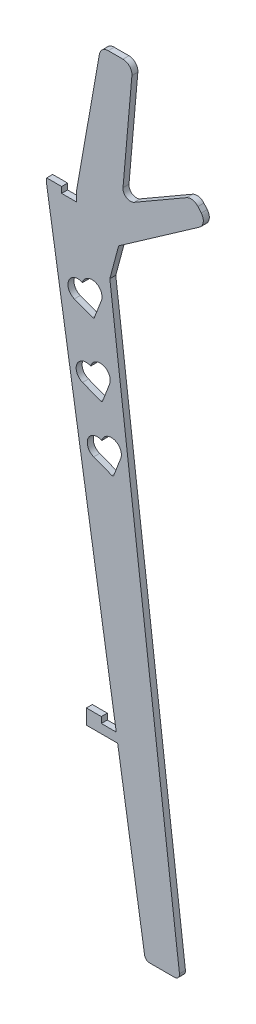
ISO-10303-21;
HEADER;
FILE_DESCRIPTION(('STEP AP214'),'2;1');
FILE_NAME('part.step','',(''),(''),'','','');
FILE_SCHEMA(('AUTOMOTIVE_DESIGN { 1 0 10303 214 1 1 1 1 }'));
ENDSEC;
DATA;
#1=APPLICATION_CONTEXT('core data for automotive mechanical design processes');
#2=APPLICATION_PROTOCOL_DEFINITION('international standard','automotive_design',2000,#1);
#3=PRODUCT_CONTEXT('',#1,'mechanical');
#4=PRODUCT('Part','Part','',(#3));
#5=PRODUCT_RELATED_PRODUCT_CATEGORY('part','',(#4));
#6=PRODUCT_DEFINITION_FORMATION('','',#4);
#7=PRODUCT_DEFINITION_CONTEXT('part definition',#1,'design');
#8=PRODUCT_DEFINITION('design','',#6,#7);
#9=PRODUCT_DEFINITION_SHAPE('','',#8);
#10=(LENGTH_UNIT() NAMED_UNIT(*) SI_UNIT(.MILLI.,.METRE.));
#11=(NAMED_UNIT(*) PLANE_ANGLE_UNIT() SI_UNIT($,.RADIAN.));
#12=(NAMED_UNIT(*) SI_UNIT($,.STERADIAN.) SOLID_ANGLE_UNIT());
#13=UNCERTAINTY_MEASURE_WITH_UNIT(LENGTH_MEASURE(1.E-05),#10,'distance_accuracy_value','');
#14=(GEOMETRIC_REPRESENTATION_CONTEXT(3) GLOBAL_UNCERTAINTY_ASSIGNED_CONTEXT((#13)) GLOBAL_UNIT_ASSIGNED_CONTEXT((#10,
#11,#12)) REPRESENTATION_CONTEXT('',''));
#15=CARTESIAN_POINT('',(0.,0.,0.));
#16=DIRECTION('',(0.,0.,1.));
#17=DIRECTION('',(1.,0.,0.));
#18=AXIS2_PLACEMENT_3D('',#15,#16,#17);
#19=CARTESIAN_POINT('',(6.71452596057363,380.,12.));
#20=DIRECTION('',(0.,-1.,0.));
#21=DIRECTION('',(1.,0.,0.));
#22=AXIS2_PLACEMENT_3D('',#19,#20,#21);
#23=PLANE('',#22);
#24=DIRECTION('',(-1.,0.,0.));
#25=VECTOR('',#24,1.);
#26=CARTESIAN_POINT('',(6.71452596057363,380.,0.));
#27=LINE('',#26,#25);
#28=CARTESIAN_POINT('',(36.7145259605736,380.,0.));
#29=VERTEX_POINT('',#28);
#30=CARTESIAN_POINT('',(6.71452596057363,380.,0.));
#31=VERTEX_POINT('',#30);
#32=EDGE_CURVE('E360',#29,#31,#27,.T.);
#33=ORIENTED_EDGE('',*,*,#32,.T.);
#34=DIRECTION('',(0.,0.,-1.));
#35=VECTOR('',#34,1.);
#36=CARTESIAN_POINT('',(6.71452596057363,380.,12.));
#37=LINE('',#36,#35);
#38=CARTESIAN_POINT('',(6.71452596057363,380.,12.));
#39=VERTEX_POINT('',#38);
#40=EDGE_CURVE('E11',#39,#31,#37,.T.);
#41=ORIENTED_EDGE('',*,*,#40,.F.);
#42=DIRECTION('',(-1.,0.,0.));
#43=VECTOR('',#42,1.);
#44=CARTESIAN_POINT('',(6.71452596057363,380.,12.));
#45=LINE('',#44,#43);
#46=CARTESIAN_POINT('',(36.7145259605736,380.,12.));
#47=VERTEX_POINT('',#46);
#48=EDGE_CURVE('E432',#47,#39,#45,.T.);
#49=ORIENTED_EDGE('',*,*,#48,.F.);
#50=DIRECTION('',(0.,0.,-1.));
#51=VECTOR('',#50,1.);
#52=CARTESIAN_POINT('',(36.7145259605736,380.,12.));
#53=LINE('',#52,#51);
#54=EDGE_CURVE('E490',#47,#29,#53,.T.);
#55=ORIENTED_EDGE('',*,*,#54,.T.);
#56=EDGE_LOOP('',(#33,#41,#49,#55));
#57=FACE_BOUND('',#56,.T.);
#58=ADVANCED_FACE('F45',(#57),#23,.F.);
#59=CARTESIAN_POINT('',(6.71452596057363,350.,12.));
#60=DIRECTION('',(1.,0.,0.));
#61=DIRECTION('',(0.,0.,-1.));
#62=AXIS2_PLACEMENT_3D('',#59,#60,#61);
#63=PLANE('',#62);
#64=DIRECTION('',(0.,-1.,0.));
#65=VECTOR('',#64,1.);
#66=CARTESIAN_POINT('',(6.71452596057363,350.,0.));
#67=LINE('',#66,#65);
#68=CARTESIAN_POINT('',(6.71452596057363,350.,0.));
#69=VERTEX_POINT('',#68);
#70=EDGE_CURVE('E493',#31,#69,#67,.T.);
#71=ORIENTED_EDGE('',*,*,#70,.T.);
#72=DIRECTION('',(0.,0.,-1.));
#73=VECTOR('',#72,1.);
#74=CARTESIAN_POINT('',(6.71452596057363,350.,12.));
#75=LINE('',#74,#73);
#76=CARTESIAN_POINT('',(6.71452596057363,350.,12.));
#77=VERTEX_POINT('',#76);
#78=EDGE_CURVE('E52',#77,#69,#75,.T.);
#79=ORIENTED_EDGE('',*,*,#78,.F.);
#80=DIRECTION('',(0.,-1.,0.));
#81=VECTOR('',#80,1.);
#82=CARTESIAN_POINT('',(6.71452596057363,350.,12.));
#83=LINE('',#82,#81);
#84=EDGE_CURVE('E435',#39,#77,#83,.T.);
#85=ORIENTED_EDGE('',*,*,#84,.F.);
#86=ORIENTED_EDGE('',*,*,#40,.T.);
#87=EDGE_LOOP('',(#71,#79,#85,#86));
#88=FACE_BOUND('',#87,.T.);
#89=ADVANCED_FACE('F649',(#88),#63,.F.);
#90=CARTESIAN_POINT('',(69.5654458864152,350.,12.));
#91=DIRECTION('',(0.,1.,0.));
#92=DIRECTION('',(0.,0.,1.));
#93=AXIS2_PLACEMENT_3D('',#90,#91,#92);
#94=PLANE('',#93);
#95=DIRECTION('',(1.,0.,0.));
#96=VECTOR('',#95,1.);
#97=CARTESIAN_POINT('',(69.5654458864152,350.,0.));
#98=LINE('',#97,#96);
#99=CARTESIAN_POINT('',(69.5654458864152,350.,0.));
#100=VERTEX_POINT('',#99);
#101=EDGE_CURVE('E495',#69,#100,#98,.T.);
#102=ORIENTED_EDGE('',*,*,#101,.T.);
#103=DIRECTION('',(0.,0.,-1.));
#104=VECTOR('',#103,1.);
#105=CARTESIAN_POINT('',(69.5654458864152,350.,12.));
#106=LINE('',#105,#104);
#107=CARTESIAN_POINT('',(69.5654458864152,350.,12.));
#108=VERTEX_POINT('',#107);
#109=EDGE_CURVE('E620',#108,#100,#106,.T.);
#110=ORIENTED_EDGE('',*,*,#109,.F.);
#111=DIRECTION('',(1.,0.,0.));
#112=VECTOR('',#111,1.);
#113=CARTESIAN_POINT('',(69.5654458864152,350.,12.));
#114=LINE('',#113,#112);
#115=EDGE_CURVE('E438',#77,#108,#114,.T.);
#116=ORIENTED_EDGE('',*,*,#115,.F.);
#117=ORIENTED_EDGE('',*,*,#78,.T.);
#118=EDGE_LOOP('',(#102,#110,#116,#117));
#119=FACE_BOUND('',#118,.T.);
#120=ADVANCED_FACE('F627',(#119),#94,.F.);
#121=CARTESIAN_POINT('',(69.5654458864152,350.,12.));
#122=DIRECTION('',(0.987688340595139,0.156434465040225,0.));
#123=DIRECTION('',(-0.156434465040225,0.987688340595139,0.));
#124=AXIS2_PLACEMENT_3D('',#121,#122,#123);
#125=PLANE('',#124);
#126=DIRECTION('',(0.156434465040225,-0.987688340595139,0.));
#127=VECTOR('',#126,1.);
#128=CARTESIAN_POINT('',(69.5654458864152,350.,0.));
#129=LINE('',#128,#127);
#130=CARTESIAN_POINT('',(123.663923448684,8.43565534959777,0.));
#131=VERTEX_POINT('',#130);
#132=EDGE_CURVE('E497',#100,#131,#129,.T.);
#133=ORIENTED_EDGE('',*,*,#132,.T.);
#134=DIRECTION('',(0.,0.,-1.));
#135=VECTOR('',#134,1.);
#136=CARTESIAN_POINT('',(123.663923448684,8.43565534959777,12.));
#137=LINE('',#136,#135);
#138=CARTESIAN_POINT('',(123.663923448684,8.43565534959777,12.));
#139=VERTEX_POINT('',#138);
#140=EDGE_CURVE('E617',#139,#131,#137,.T.);
#141=ORIENTED_EDGE('',*,*,#140,.F.);
#142=DIRECTION('',(0.156434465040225,-0.987688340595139,0.));
#143=VECTOR('',#142,1.);
#144=CARTESIAN_POINT('',(69.5654458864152,350.,12.));
#145=LINE('',#144,#143);
#146=EDGE_CURVE('E440',#108,#139,#145,.T.);
#147=ORIENTED_EDGE('',*,*,#146,.F.);
#148=ORIENTED_EDGE('',*,*,#109,.T.);
#149=EDGE_LOOP('',(#133,#141,#147,#148));
#150=FACE_BOUND('',#149,.T.);
#151=ADVANCED_FACE('F638',(#150),#125,.F.);
#152=CARTESIAN_POINT('',(133.540806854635,10.,12.));
#153=DIRECTION('',(0.,0.,-1.));
#154=DIRECTION('',(-1.,0.,0.));
#155=AXIS2_PLACEMENT_3D('',#152,#153,#154);
#156=CYLINDRICAL_SURFACE('',#155,10.);
#157=CARTESIAN_POINT('',(133.540806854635,10.,0.));
#158=DIRECTION('',(0.,0.,1.));
#159=DIRECTION('',(-1.,0.,0.));
#160=AXIS2_PLACEMENT_3D('',#157,#158,#159);
#161=CIRCLE('',#160,10.);
#162=CARTESIAN_POINT('',(133.540806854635,0.,0.));
#163=VERTEX_POINT('',#162);
#164=EDGE_CURVE('E499',#131,#163,#161,.T.);
#165=ORIENTED_EDGE('',*,*,#164,.T.);
#166=DIRECTION('',(0.,0.,-1.));
#167=VECTOR('',#166,1.);
#168=CARTESIAN_POINT('',(133.540806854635,0.,12.));
#169=LINE('',#168,#167);
#170=CARTESIAN_POINT('',(133.540806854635,0.,12.));
#171=VERTEX_POINT('',#170);
#172=EDGE_CURVE('E614',#171,#163,#169,.T.);
#173=ORIENTED_EDGE('',*,*,#172,.F.);
#174=CARTESIAN_POINT('',(133.540806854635,10.,12.));
#175=DIRECTION('',(0.,0.,1.));
#176=DIRECTION('',(-1.,0.,0.));
#177=AXIS2_PLACEMENT_3D('',#174,#175,#176);
#178=CIRCLE('',#177,10.);
#179=EDGE_CURVE('E442',#139,#171,#178,.T.);
#180=ORIENTED_EDGE('',*,*,#179,.F.);
#181=ORIENTED_EDGE('',*,*,#140,.T.);
#182=EDGE_LOOP('',(#165,#173,#180,#181));
#183=FACE_BOUND('',#182,.T.);
#184=ADVANCED_FACE('F642',(#183),#156,.T.);
#185=CARTESIAN_POINT('',(133.540806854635,0.,12.));
#186=DIRECTION('',(0.,1.,0.));
#187=DIRECTION('',(-1.,0.,0.));
#188=AXIS2_PLACEMENT_3D('',#185,#186,#187);
#189=PLANE('',#188);
#190=DIRECTION('',(1.,0.,0.));
#191=VECTOR('',#190,1.);
#192=CARTESIAN_POINT('',(133.540806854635,0.,0.));
#193=LINE('',#192,#191);
#194=CARTESIAN_POINT('',(183.697056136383,0.,0.));
#195=VERTEX_POINT('',#194);
#196=EDGE_CURVE('E501',#163,#195,#193,.T.);
#197=ORIENTED_EDGE('',*,*,#196,.T.);
#198=DIRECTION('',(0.,0.,-1.));
#199=VECTOR('',#198,1.);
#200=CARTESIAN_POINT('',(183.697056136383,0.,12.));
#201=LINE('',#200,#199);
#202=CARTESIAN_POINT('',(183.697056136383,0.,12.));
#203=VERTEX_POINT('',#202);
#204=EDGE_CURVE('E611',#203,#195,#201,.T.);
#205=ORIENTED_EDGE('',*,*,#204,.F.);
#206=DIRECTION('',(1.,0.,0.));
#207=VECTOR('',#206,1.);
#208=CARTESIAN_POINT('',(133.540806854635,0.,12.));
#209=LINE('',#208,#207);
#210=EDGE_CURVE('E444',#171,#203,#209,.T.);
#211=ORIENTED_EDGE('',*,*,#210,.F.);
#212=ORIENTED_EDGE('',*,*,#172,.T.);
#213=EDGE_LOOP('',(#197,#205,#211,#212));
#214=FACE_BOUND('',#213,.T.);
#215=ADVANCED_FACE('F762',(#214),#189,.F.);
#216=CARTESIAN_POINT('',(183.697056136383,10.,12.));
#217=DIRECTION('',(0.,0.,-1.));
#218=DIRECTION('',(-1.,0.,0.));
#219=AXIS2_PLACEMENT_3D('',#216,#217,#218);
#220=CYLINDRICAL_SURFACE('',#219,10.);
#221=CARTESIAN_POINT('',(183.697056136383,10.,0.));
#222=DIRECTION('',(0.,0.,1.));
#223=DIRECTION('',(-1.,0.,0.));
#224=AXIS2_PLACEMENT_3D('',#221,#222,#223);
#225=CIRCLE('',#224,10.);
#226=CARTESIAN_POINT('',(193.622517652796,11.2186934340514,0.));
#227=VERTEX_POINT('',#226);
#228=EDGE_CURVE('E503',#195,#227,#225,.T.);
#229=ORIENTED_EDGE('',*,*,#228,.T.);
#230=DIRECTION('',(0.,0.,-1.));
#231=VECTOR('',#230,1.);
#232=CARTESIAN_POINT('',(193.622517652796,11.2186934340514,12.));
#233=LINE('',#232,#231);
#234=CARTESIAN_POINT('',(193.622517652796,11.2186934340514,12.));
#235=VERTEX_POINT('',#234);
#236=EDGE_CURVE('E608',#235,#227,#233,.T.);
#237=ORIENTED_EDGE('',*,*,#236,.F.);
#238=CARTESIAN_POINT('',(183.697056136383,10.,12.));
#239=DIRECTION('',(0.,0.,1.));
#240=DIRECTION('',(-1.,0.,0.));
#241=AXIS2_PLACEMENT_3D('',#238,#239,#240);
#242=CIRCLE('',#241,10.);
#243=EDGE_CURVE('E446',#203,#235,#242,.T.);
#244=ORIENTED_EDGE('',*,*,#243,.F.);
#245=ORIENTED_EDGE('',*,*,#204,.T.);
#246=EDGE_LOOP('',(#229,#237,#244,#245));
#247=FACE_BOUND('',#246,.T.);
#248=ADVANCED_FACE('F759',(#247),#220,.T.);
#249=CARTESIAN_POINT('',(53.797754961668,1150.,12.));
#250=DIRECTION('',(-0.992546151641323,-0.121869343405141,0.));
#251=DIRECTION('',(0.121869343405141,-0.992546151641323,0.));
#252=AXIS2_PLACEMENT_3D('',#249,#250,#251);
#253=PLANE('',#252);
#254=DIRECTION('',(-0.121869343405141,0.992546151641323,0.));
#255=VECTOR('',#254,1.);
#256=CARTESIAN_POINT('',(53.797754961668,1150.,0.));
#257=LINE('',#256,#255);
#258=CARTESIAN_POINT('',(53.797754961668,1150.,0.));
#259=VERTEX_POINT('',#258);
#260=EDGE_CURVE('E505',#227,#259,#257,.T.);
#261=ORIENTED_EDGE('',*,*,#260,.T.);
#262=DIRECTION('',(0.,0.,-1.));
#263=VECTOR('',#262,1.);
#264=CARTESIAN_POINT('',(53.797754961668,1150.,12.));
#265=LINE('',#264,#263);
#266=CARTESIAN_POINT('',(53.797754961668,1150.,12.));
#267=VERTEX_POINT('',#266);
#268=EDGE_CURVE('E605',#267,#259,#265,.T.);
#269=ORIENTED_EDGE('',*,*,#268,.F.);
#270=DIRECTION('',(-0.121869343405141,0.992546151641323,0.));
#271=VECTOR('',#270,1.);
#272=CARTESIAN_POINT('',(53.797754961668,1150.,12.));
#273=LINE('',#272,#271);
#274=EDGE_CURVE('E448',#235,#267,#273,.T.);
#275=ORIENTED_EDGE('',*,*,#274,.F.);
#276=ORIENTED_EDGE('',*,*,#236,.T.);
#277=EDGE_LOOP('',(#261,#269,#275,#276));
#278=FACE_BOUND('',#277,.T.);
#279=ADVANCED_FACE('F755',(#278),#253,.F.);
#280=CARTESIAN_POINT('',(71.4814991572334,1215.9966318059,12.));
#281=DIRECTION('',(-0.965925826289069,0.25881904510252,0.));
#282=DIRECTION('',(-0.25881904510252,-0.965925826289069,0.));
#283=AXIS2_PLACEMENT_3D('',#280,#281,#282);
#284=PLANE('',#283);
#285=DIRECTION('',(0.25881904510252,0.965925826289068,0.));
#286=VECTOR('',#285,1.);
#287=CARTESIAN_POINT('',(71.4814991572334,1215.9966318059,0.));
#288=LINE('',#287,#286);
#289=CARTESIAN_POINT('',(71.4814991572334,1215.9966318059,0.));
#290=VERTEX_POINT('',#289);
#291=EDGE_CURVE('E507',#259,#290,#288,.T.);
#292=ORIENTED_EDGE('',*,*,#291,.T.);
#293=DIRECTION('',(0.,0.,-1.));
#294=VECTOR('',#293,1.);
#295=CARTESIAN_POINT('',(71.4814991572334,1215.9966318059,12.));
#296=LINE('',#295,#294);
#297=CARTESIAN_POINT('',(71.4814991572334,1215.9966318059,12.));
#298=VERTEX_POINT('',#297);
#299=EDGE_CURVE('E602',#298,#290,#296,.T.);
#300=ORIENTED_EDGE('',*,*,#299,.F.);
#301=DIRECTION('',(0.25881904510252,0.965925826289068,0.));
#302=VECTOR('',#301,1.);
#303=CARTESIAN_POINT('',(71.4814991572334,1215.9966318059,12.));
#304=LINE('',#303,#302);
#305=EDGE_CURVE('E450',#267,#298,#304,.T.);
#306=ORIENTED_EDGE('',*,*,#305,.F.);
#307=ORIENTED_EDGE('',*,*,#268,.T.);
#308=EDGE_LOOP('',(#292,#300,#306,#307));
#309=FACE_BOUND('',#308,.T.);
#310=ADVANCED_FACE('F751',(#309),#284,.F.);
#311=CARTESIAN_POINT('',(233.908943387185,1329.72955266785,12.));
#312=DIRECTION('',(-0.573576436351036,0.819152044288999,0.));
#313=DIRECTION('',(-0.819152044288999,-0.573576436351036,0.));
#314=AXIS2_PLACEMENT_3D('',#311,#312,#313);
#315=PLANE('',#314);
#316=DIRECTION('',(0.819152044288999,0.573576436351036,0.));
#317=VECTOR('',#316,1.);
#318=CARTESIAN_POINT('',(233.908943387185,1329.72955266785,0.));
#319=LINE('',#318,#317);
#320=CARTESIAN_POINT('',(233.908943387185,1329.72955266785,0.));
#321=VERTEX_POINT('',#320);
#322=EDGE_CURVE('E509',#290,#321,#319,.T.);
#323=ORIENTED_EDGE('',*,*,#322,.T.);
#324=DIRECTION('',(0.,0.,-1.));
#325=VECTOR('',#324,1.);
#326=CARTESIAN_POINT('',(233.908943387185,1329.72955266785,12.));
#327=LINE('',#326,#325);
#328=CARTESIAN_POINT('',(233.908943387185,1329.72955266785,12.));
#329=VERTEX_POINT('',#328);
#330=EDGE_CURVE('E599',#329,#321,#327,.T.);
#331=ORIENTED_EDGE('',*,*,#330,.F.);
#332=DIRECTION('',(0.819152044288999,0.573576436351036,0.));
#333=VECTOR('',#332,1.);
#334=CARTESIAN_POINT('',(233.908943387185,1329.72955266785,12.));
#335=LINE('',#334,#333);
#336=EDGE_CURVE('E452',#298,#329,#335,.T.);
#337=ORIENTED_EDGE('',*,*,#336,.F.);
#338=ORIENTED_EDGE('',*,*,#299,.T.);
#339=EDGE_LOOP('',(#323,#331,#337,#338));
#340=FACE_BOUND('',#339,.T.);
#341=ADVANCED_FACE('F746',(#340),#315,.F.);
#342=CARTESIAN_POINT('',(223.584567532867,1344.47428946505,12.));
#343=DIRECTION('',(0.,0.,-1.));
#344=DIRECTION('',(-1.,0.,0.));
#345=AXIS2_PLACEMENT_3D('',#342,#343,#344);
#346=CYLINDRICAL_SURFACE('',#345,18.0000000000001);
#347=CARTESIAN_POINT('',(223.584567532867,1344.47428946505,0.));
#348=DIRECTION('',(0.,0.,1.));
#349=DIRECTION('',(1.,0.,0.));
#350=AXIS2_PLACEMENT_3D('',#347,#348,#349);
#351=CIRCLE('',#350,18.0000000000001);
#352=CARTESIAN_POINT('',(237.373367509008,1356.04446643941,0.));
#353=VERTEX_POINT('',#352);
#354=EDGE_CURVE('E511',#321,#353,#351,.T.);
#355=ORIENTED_EDGE('',*,*,#354,.T.);
#356=DIRECTION('',(0.,0.,-1.));
#357=VECTOR('',#356,1.);
#358=CARTESIAN_POINT('',(237.373367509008,1356.04446643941,12.));
#359=LINE('',#358,#357);
#360=CARTESIAN_POINT('',(237.373367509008,1356.04446643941,12.));
#361=VERTEX_POINT('',#360);
#362=EDGE_CURVE('E596',#361,#353,#359,.T.);
#363=ORIENTED_EDGE('',*,*,#362,.F.);
#364=CARTESIAN_POINT('',(223.584567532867,1344.47428946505,12.));
#365=DIRECTION('',(0.,0.,1.));
#366=DIRECTION('',(1.,0.,0.));
#367=AXIS2_PLACEMENT_3D('',#364,#365,#366);
#368=CIRCLE('',#367,18.0000000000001);
#369=EDGE_CURVE('E454',#329,#361,#368,.T.);
#370=ORIENTED_EDGE('',*,*,#369,.F.);
#371=ORIENTED_EDGE('',*,*,#330,.T.);
#372=EDGE_LOOP('',(#355,#363,#370,#371));
#373=FACE_BOUND('',#372,.T.);
#374=ADVANCED_FACE('F740',(#373),#346,.T.);
#375=CARTESIAN_POINT('',(230.674738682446,1364.02758140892,12.));
#376=DIRECTION('',(-0.766044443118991,-0.642787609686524,0.));
#377=DIRECTION('',(0.642787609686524,-0.766044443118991,0.));
#378=AXIS2_PLACEMENT_3D('',#375,#376,#377);
#379=PLANE('',#378);
#380=DIRECTION('',(-0.642787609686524,0.766044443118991,0.));
#381=VECTOR('',#380,1.);
#382=CARTESIAN_POINT('',(230.674738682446,1364.02758140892,0.));
#383=LINE('',#382,#381);
#384=CARTESIAN_POINT('',(230.674738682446,1364.02758140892,0.));
#385=VERTEX_POINT('',#384);
#386=EDGE_CURVE('E513',#353,#385,#383,.T.);
#387=ORIENTED_EDGE('',*,*,#386,.T.);
#388=DIRECTION('',(0.,0.,-1.));
#389=VECTOR('',#388,1.);
#390=CARTESIAN_POINT('',(230.674738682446,1364.02758140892,12.));
#391=LINE('',#390,#389);
#392=CARTESIAN_POINT('',(230.674738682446,1364.02758140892,12.));
#393=VERTEX_POINT('',#392);
#394=EDGE_CURVE('E593',#393,#385,#391,.T.);
#395=ORIENTED_EDGE('',*,*,#394,.F.);
#396=DIRECTION('',(-0.642787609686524,0.766044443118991,0.));
#397=VECTOR('',#396,1.);
#398=CARTESIAN_POINT('',(230.674738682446,1364.02758140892,12.));
#399=LINE('',#398,#397);
#400=EDGE_CURVE('E456',#361,#393,#399,.T.);
#401=ORIENTED_EDGE('',*,*,#400,.F.);
#402=ORIENTED_EDGE('',*,*,#362,.T.);
#403=EDGE_LOOP('',(#387,#395,#401,#402));
#404=FACE_BOUND('',#403,.T.);
#405=ADVANCED_FACE('F736',(#404),#379,.F.);
#406=CARTESIAN_POINT('',(216.885938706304,1352.45740443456,12.));
#407=DIRECTION('',(0.,0.,-1.));
#408=DIRECTION('',(-1.,0.,0.));
#409=AXIS2_PLACEMENT_3D('',#406,#407,#408);
#410=CYLINDRICAL_SURFACE('',#409,17.9999999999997);
#411=CARTESIAN_POINT('',(216.885938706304,1352.45740443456,0.));
#412=DIRECTION('',(0.,0.,1.));
#413=DIRECTION('',(1.,0.,0.));
#414=AXIS2_PLACEMENT_3D('',#411,#412,#413);
#415=CIRCLE('',#414,17.9999999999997);
#416=CARTESIAN_POINT('',(207.885938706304,1368.04586170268,0.));
#417=VERTEX_POINT('',#416);
#418=EDGE_CURVE('E515',#385,#417,#415,.T.);
#419=ORIENTED_EDGE('',*,*,#418,.T.);
#420=DIRECTION('',(0.,0.,-1.));
#421=VECTOR('',#420,1.);
#422=CARTESIAN_POINT('',(207.885938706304,1368.04586170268,12.));
#423=LINE('',#422,#421);
#424=CARTESIAN_POINT('',(207.885938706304,1368.04586170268,12.));
#425=VERTEX_POINT('',#424);
#426=EDGE_CURVE('E590',#425,#417,#423,.T.);
#427=ORIENTED_EDGE('',*,*,#426,.F.);
#428=CARTESIAN_POINT('',(216.885938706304,1352.45740443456,12.));
#429=DIRECTION('',(0.,0.,1.));
#430=DIRECTION('',(1.,0.,0.));
#431=AXIS2_PLACEMENT_3D('',#428,#429,#430);
#432=CIRCLE('',#431,17.9999999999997);
#433=EDGE_CURVE('E458',#393,#425,#432,.T.);
#434=ORIENTED_EDGE('',*,*,#433,.F.);
#435=ORIENTED_EDGE('',*,*,#394,.T.);
#436=EDGE_LOOP('',(#419,#427,#434,#435));
#437=FACE_BOUND('',#436,.T.);
#438=ADVANCED_FACE('F731',(#437),#410,.T.);
#439=CARTESIAN_POINT('',(207.885938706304,1368.04586170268,12.));
#440=DIRECTION('',(0.49999999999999,-0.866025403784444,0.));
#441=DIRECTION('',(0.866025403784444,0.49999999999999,0.));
#442=AXIS2_PLACEMENT_3D('',#439,#440,#441);
#443=PLANE('',#442);
#444=DIRECTION('',(-0.866025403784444,-0.49999999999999,0.));
#445=VECTOR('',#444,1.);
#446=CARTESIAN_POINT('',(207.885938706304,1368.04586170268,0.));
#447=LINE('',#446,#445);
#448=CARTESIAN_POINT('',(102.731286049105,1307.33479468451,0.));
#449=VERTEX_POINT('',#448);
#450=EDGE_CURVE('E517',#417,#449,#447,.T.);
#451=ORIENTED_EDGE('',*,*,#450,.T.);
#452=DIRECTION('',(0.,0.,-1.));
#453=VECTOR('',#452,1.);
#454=CARTESIAN_POINT('',(102.731286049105,1307.33479468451,12.));
#455=LINE('',#454,#453);
#456=CARTESIAN_POINT('',(102.731286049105,1307.33479468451,12.));
#457=VERTEX_POINT('',#456);
#458=EDGE_CURVE('E587',#457,#449,#455,.T.);
#459=ORIENTED_EDGE('',*,*,#458,.F.);
#460=DIRECTION('',(-0.866025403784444,-0.49999999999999,0.));
#461=VECTOR('',#460,1.);
#462=CARTESIAN_POINT('',(207.885938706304,1368.04586170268,12.));
#463=LINE('',#462,#461);
#464=EDGE_CURVE('E460',#425,#457,#463,.T.);
#465=ORIENTED_EDGE('',*,*,#464,.F.);
#466=ORIENTED_EDGE('',*,*,#426,.T.);
#467=EDGE_LOOP('',(#451,#459,#465,#466));
#468=FACE_BOUND('',#467,.T.);
#469=ADVANCED_FACE('F725',(#468),#443,.F.);
#470=CARTESIAN_POINT('',(95.2312860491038,1320.32517574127,12.));
#471=DIRECTION('',(0.,0.,-1.));
#472=DIRECTION('',(-1.,0.,0.));
#473=AXIS2_PLACEMENT_3D('',#470,#471,#472);
#474=CYLINDRICAL_SURFACE('',#473,14.9999999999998);
#475=CARTESIAN_POINT('',(95.2312860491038,1320.32517574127,0.));
#476=DIRECTION('',(0.,0.,-1.));
#477=DIRECTION('',(1.,0.,0.));
#478=AXIS2_PLACEMENT_3D('',#475,#476,#477);
#479=CIRCLE('',#478,14.9999999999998);
#480=CARTESIAN_POINT('',(80.2883655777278,1321.63251188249,0.));
#481=VERTEX_POINT('',#480);
#482=EDGE_CURVE('E519',#449,#481,#479,.T.);
#483=ORIENTED_EDGE('',*,*,#482,.T.);
#484=DIRECTION('',(0.,0.,-1.));
#485=VECTOR('',#484,1.);
#486=CARTESIAN_POINT('',(80.2883655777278,1321.63251188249,12.));
#487=LINE('',#486,#485);
#488=CARTESIAN_POINT('',(80.2883655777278,1321.63251188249,12.));
#489=VERTEX_POINT('',#488);
#490=EDGE_CURVE('E584',#489,#481,#487,.T.);
#491=ORIENTED_EDGE('',*,*,#490,.F.);
#492=CARTESIAN_POINT('',(95.2312860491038,1320.32517574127,12.));
#493=DIRECTION('',(0.,0.,-1.));
#494=DIRECTION('',(1.,0.,0.));
#495=AXIS2_PLACEMENT_3D('',#492,#493,#494);
#496=CIRCLE('',#495,14.9999999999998);
#497=EDGE_CURVE('E462',#457,#489,#496,.T.);
#498=ORIENTED_EDGE('',*,*,#497,.F.);
#499=ORIENTED_EDGE('',*,*,#458,.T.);
#500=EDGE_LOOP('',(#483,#491,#498,#499));
#501=FACE_BOUND('',#500,.T.);
#502=ADVANCED_FACE('F721',(#501),#474,.F.);
#503=CARTESIAN_POINT('',(98.118440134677,1525.43119663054,12.));
#504=DIRECTION('',(-0.996194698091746,0.0871557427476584,0.));
#505=DIRECTION('',(-0.0871557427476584,-0.996194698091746,0.));
#506=AXIS2_PLACEMENT_3D('',#503,#504,#505);
#507=PLANE('',#506);
#508=DIRECTION('',(0.0871557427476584,0.996194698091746,0.));
#509=VECTOR('',#508,1.);
#510=CARTESIAN_POINT('',(98.118440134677,1525.43119663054,0.));
#511=LINE('',#510,#509);
#512=CARTESIAN_POINT('',(98.118440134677,1525.43119663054,0.));
#513=VERTEX_POINT('',#512);
#514=EDGE_CURVE('E521',#481,#513,#511,.T.);
#515=ORIENTED_EDGE('',*,*,#514,.T.);
#516=DIRECTION('',(0.,0.,-1.));
#517=VECTOR('',#516,1.);
#518=CARTESIAN_POINT('',(98.118440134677,1525.43119663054,12.));
#519=LINE('',#518,#517);
#520=CARTESIAN_POINT('',(98.118440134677,1525.43119663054,12.));
#521=VERTEX_POINT('',#520);
#522=EDGE_CURVE('E581',#521,#513,#519,.T.);
#523=ORIENTED_EDGE('',*,*,#522,.F.);
#524=DIRECTION('',(0.0871557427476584,0.996194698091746,0.));
#525=VECTOR('',#524,1.);
#526=CARTESIAN_POINT('',(98.118440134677,1525.43119663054,12.));
#527=LINE('',#526,#525);
#528=EDGE_CURVE('E464',#489,#521,#527,.T.);
#529=ORIENTED_EDGE('',*,*,#528,.F.);
#530=ORIENTED_EDGE('',*,*,#490,.T.);
#531=EDGE_LOOP('',(#515,#523,#529,#530));
#532=FACE_BOUND('',#531,.T.);
#533=ADVANCED_FACE('F716',(#532),#507,.F.);
#534=CARTESIAN_POINT('',(80.1869355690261,1527.,12.));
#535=DIRECTION('',(0.,0.,-1.));
#536=DIRECTION('',(-1.,0.,0.));
#537=AXIS2_PLACEMENT_3D('',#534,#535,#536);
#538=CYLINDRICAL_SURFACE('',#537,17.9999999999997);
#539=CARTESIAN_POINT('',(80.1869355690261,1527.,0.));
#540=DIRECTION('',(0.,0.,1.));
#541=DIRECTION('',(1.,0.,0.));
#542=AXIS2_PLACEMENT_3D('',#539,#540,#541);
#543=CIRCLE('',#542,17.9999999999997);
#544=CARTESIAN_POINT('',(80.1869355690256,1545.,0.));
#545=VERTEX_POINT('',#544);
#546=EDGE_CURVE('E523',#513,#545,#543,.T.);
#547=ORIENTED_EDGE('',*,*,#546,.T.);
#548=DIRECTION('',(0.,0.,-1.));
#549=VECTOR('',#548,1.);
#550=CARTESIAN_POINT('',(80.1869355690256,1545.,12.));
#551=LINE('',#550,#549);
#552=CARTESIAN_POINT('',(80.1869355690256,1545.,12.));
#553=VERTEX_POINT('',#552);
#554=EDGE_CURVE('E578',#553,#545,#551,.T.);
#555=ORIENTED_EDGE('',*,*,#554,.F.);
#556=CARTESIAN_POINT('',(80.1869355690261,1527.,12.));
#557=DIRECTION('',(0.,0.,1.));
#558=DIRECTION('',(1.,0.,0.));
#559=AXIS2_PLACEMENT_3D('',#556,#557,#558);
#560=CIRCLE('',#559,17.9999999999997);
#561=EDGE_CURVE('E466',#521,#553,#560,.T.);
#562=ORIENTED_EDGE('',*,*,#561,.F.);
#563=ORIENTED_EDGE('',*,*,#522,.T.);
#564=EDGE_LOOP('',(#547,#555,#562,#563));
#565=FACE_BOUND('',#564,.T.);
#566=ADVANCED_FACE('F710',(#565),#538,.T.);
#567=CARTESIAN_POINT('',(50.6131626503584,1545.,12.));
#568=DIRECTION('',(0.,-1.,0.));
#569=DIRECTION('',(0.,0.,-1.));
#570=AXIS2_PLACEMENT_3D('',#567,#568,#569);
#571=PLANE('',#570);
#572=DIRECTION('',(-1.,0.,0.));
#573=VECTOR('',#572,1.);
#574=CARTESIAN_POINT('',(50.6131626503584,1545.,0.));
#575=LINE('',#574,#573);
#576=CARTESIAN_POINT('',(50.6131626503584,1545.,0.));
#577=VERTEX_POINT('',#576);
#578=EDGE_CURVE('E525',#545,#577,#575,.T.);
#579=ORIENTED_EDGE('',*,*,#578,.T.);
#580=DIRECTION('',(0.,0.,-1.));
#581=VECTOR('',#580,1.);
#582=CARTESIAN_POINT('',(50.6131626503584,1545.,12.));
#583=LINE('',#582,#581);
#584=CARTESIAN_POINT('',(50.6131626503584,1545.,12.));
#585=VERTEX_POINT('',#584);
#586=EDGE_CURVE('E575',#585,#577,#583,.T.);
#587=ORIENTED_EDGE('',*,*,#586,.F.);
#588=DIRECTION('',(-1.,0.,0.));
#589=VECTOR('',#588,1.);
#590=CARTESIAN_POINT('',(50.6131626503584,1545.,12.));
#591=LINE('',#590,#589);
#592=EDGE_CURVE('E468',#553,#585,#591,.T.);
#593=ORIENTED_EDGE('',*,*,#592,.F.);
#594=ORIENTED_EDGE('',*,*,#554,.T.);
#595=EDGE_LOOP('',(#579,#587,#593,#594));
#596=FACE_BOUND('',#595,.T.);
#597=ADVANCED_FACE('F706',(#596),#571,.F.);
#598=CARTESIAN_POINT('',(50.6131626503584,1527.,12.));
#599=DIRECTION('',(0.,0.,-1.));
#600=DIRECTION('',(-1.,0.,0.));
#601=AXIS2_PLACEMENT_3D('',#598,#599,#600);
#602=CYLINDRICAL_SURFACE('',#601,18.);
#603=CARTESIAN_POINT('',(50.6131626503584,1527.,0.));
#604=DIRECTION('',(0.,0.,1.));
#605=DIRECTION('',(1.,0.,0.));
#606=AXIS2_PLACEMENT_3D('',#603,#604,#605);
#607=CIRCLE('',#606,18.);
#608=CARTESIAN_POINT('',(32.8866230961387,1530.12566719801,0.));
#609=VERTEX_POINT('',#608);
#610=EDGE_CURVE('E527',#577,#609,#607,.T.);
#611=ORIENTED_EDGE('',*,*,#610,.T.);
#612=DIRECTION('',(0.,0.,-1.));
#613=VECTOR('',#612,1.);
#614=CARTESIAN_POINT('',(32.8866230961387,1530.12566719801,12.));
#615=LINE('',#614,#613);
#616=CARTESIAN_POINT('',(32.8866230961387,1530.12566719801,12.));
#617=VERTEX_POINT('',#616);
#618=EDGE_CURVE('E572',#617,#609,#615,.T.);
#619=ORIENTED_EDGE('',*,*,#618,.F.);
#620=CARTESIAN_POINT('',(50.6131626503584,1527.,12.));
#621=DIRECTION('',(0.,0.,1.));
#622=DIRECTION('',(1.,0.,0.));
#623=AXIS2_PLACEMENT_3D('',#620,#621,#622);
#624=CIRCLE('',#623,18.);
#625=EDGE_CURVE('E470',#585,#617,#624,.T.);
#626=ORIENTED_EDGE('',*,*,#625,.F.);
#627=ORIENTED_EDGE('',*,*,#586,.T.);
#628=EDGE_LOOP('',(#611,#619,#626,#627));
#629=FACE_BOUND('',#628,.T.);
#630=ADVANCED_FACE('F701',(#629),#602,.T.);
#631=CARTESIAN_POINT('',(32.8866230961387,1530.12566719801,12.));
#632=DIRECTION('',(0.984807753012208,-0.173648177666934,0.));
#633=DIRECTION('',(0.173648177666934,0.984807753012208,0.));
#634=AXIS2_PLACEMENT_3D('',#631,#632,#633);
#635=PLANE('',#634);
#636=DIRECTION('',(-0.173648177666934,-0.984807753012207,0.));
#637=VECTOR('',#636,1.);
#638=CARTESIAN_POINT('',(32.8866230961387,1530.12566719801,0.));
#639=LINE('',#638,#637);
#640=CARTESIAN_POINT('',(-12.9805504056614,1270.,0.));
#641=VERTEX_POINT('',#640);
#642=EDGE_CURVE('E529',#609,#641,#639,.T.);
#643=ORIENTED_EDGE('',*,*,#642,.T.);
#644=DIRECTION('',(0.,0.,-1.));
#645=VECTOR('',#644,1.);
#646=CARTESIAN_POINT('',(-12.9805504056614,1270.,12.));
#647=LINE('',#646,#645);
#648=CARTESIAN_POINT('',(-12.9805504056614,1270.,12.));
#649=VERTEX_POINT('',#648);
#650=EDGE_CURVE('E569',#649,#641,#647,.T.);
#651=ORIENTED_EDGE('',*,*,#650,.F.);
#652=DIRECTION('',(-0.173648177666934,-0.984807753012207,0.));
#653=VECTOR('',#652,1.);
#654=CARTESIAN_POINT('',(32.8866230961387,1530.12566719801,12.));
#655=LINE('',#654,#653);
#656=EDGE_CURVE('E472',#617,#649,#655,.T.);
#657=ORIENTED_EDGE('',*,*,#656,.F.);
#658=ORIENTED_EDGE('',*,*,#618,.T.);
#659=EDGE_LOOP('',(#643,#651,#657,#658));
#660=FACE_BOUND('',#659,.T.);
#661=ADVANCED_FACE('F695',(#660),#635,.F.);
#662=CARTESIAN_POINT('',(-12.9805504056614,1250.,12.));
#663=DIRECTION('',(1.,0.,0.));
#664=DIRECTION('',(0.,0.,-1.));
#665=AXIS2_PLACEMENT_3D('',#662,#663,#664);
#666=PLANE('',#665);
#667=DIRECTION('',(0.,-1.,0.));
#668=VECTOR('',#667,1.);
#669=CARTESIAN_POINT('',(-12.9805504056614,1250.,0.));
#670=LINE('',#669,#668);
#671=CARTESIAN_POINT('',(-12.9805504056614,1250.,0.));
#672=VERTEX_POINT('',#671);
#673=EDGE_CURVE('E531',#641,#672,#670,.T.);
#674=ORIENTED_EDGE('',*,*,#673,.T.);
#675=DIRECTION('',(0.,0.,-1.));
#676=VECTOR('',#675,1.);
#677=CARTESIAN_POINT('',(-12.9805504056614,1250.,12.));
#678=LINE('',#677,#676);
#679=CARTESIAN_POINT('',(-12.9805504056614,1250.,12.));
#680=VERTEX_POINT('',#679);
#681=EDGE_CURVE('E566',#680,#672,#678,.T.);
#682=ORIENTED_EDGE('',*,*,#681,.F.);
#683=DIRECTION('',(0.,-1.,0.));
#684=VECTOR('',#683,1.);
#685=CARTESIAN_POINT('',(-12.9805504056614,1250.,12.));
#686=LINE('',#685,#684);
#687=EDGE_CURVE('E474',#649,#680,#686,.T.);
#688=ORIENTED_EDGE('',*,*,#687,.F.);
#689=ORIENTED_EDGE('',*,*,#650,.T.);
#690=EDGE_LOOP('',(#674,#682,#688,#689));
#691=FACE_BOUND('',#690,.T.);
#692=ADVANCED_FACE('F691',(#691),#666,.F.);
#693=CARTESIAN_POINT('',(-42.9805504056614,1250.,12.));
#694=DIRECTION('',(0.,-1.,0.));
#695=DIRECTION('',(1.,0.,0.));
#696=AXIS2_PLACEMENT_3D('',#693,#694,#695);
#697=PLANE('',#696);
#698=DIRECTION('',(-1.,0.,0.));
#699=VECTOR('',#698,1.);
#700=CARTESIAN_POINT('',(-42.9805504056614,1250.,0.));
#701=LINE('',#700,#699);
#702=CARTESIAN_POINT('',(-42.9805504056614,1250.,0.));
#703=VERTEX_POINT('',#702);
#704=EDGE_CURVE('E533',#672,#703,#701,.T.);
#705=ORIENTED_EDGE('',*,*,#704,.T.);
#706=DIRECTION('',(0.,0.,-1.));
#707=VECTOR('',#706,1.);
#708=CARTESIAN_POINT('',(-42.9805504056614,1250.,12.));
#709=LINE('',#708,#707);
#710=CARTESIAN_POINT('',(-42.9805504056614,1250.,12.));
#711=VERTEX_POINT('',#710);
#712=EDGE_CURVE('E563',#711,#703,#709,.T.);
#713=ORIENTED_EDGE('',*,*,#712,.F.);
#714=DIRECTION('',(-1.,0.,0.));
#715=VECTOR('',#714,1.);
#716=CARTESIAN_POINT('',(-42.9805504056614,1250.,12.));
#717=LINE('',#716,#715);
#718=EDGE_CURVE('E476',#680,#711,#717,.T.);
#719=ORIENTED_EDGE('',*,*,#718,.F.);
#720=ORIENTED_EDGE('',*,*,#681,.T.);
#721=EDGE_LOOP('',(#705,#713,#719,#720));
#722=FACE_BOUND('',#721,.T.);
#723=ADVANCED_FACE('F686',(#722),#697,.F.);
#724=CARTESIAN_POINT('',(-42.9805504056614,1262.,12.));
#725=DIRECTION('',(-1.,0.,0.));
#726=DIRECTION('',(0.,0.,1.));
#727=AXIS2_PLACEMENT_3D('',#724,#725,#726);
#728=PLANE('',#727);
#729=DIRECTION('',(0.,1.,0.));
#730=VECTOR('',#729,1.);
#731=CARTESIAN_POINT('',(-42.9805504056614,1262.,0.));
#732=LINE('',#731,#730);
#733=CARTESIAN_POINT('',(-42.9805504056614,1262.,0.));
#734=VERTEX_POINT('',#733);
#735=EDGE_CURVE('E535',#703,#734,#732,.T.);
#736=ORIENTED_EDGE('',*,*,#735,.T.);
#737=DIRECTION('',(0.,0.,-1.));
#738=VECTOR('',#737,1.);
#739=CARTESIAN_POINT('',(-42.9805504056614,1262.,12.));
#740=LINE('',#739,#738);
#741=CARTESIAN_POINT('',(-42.9805504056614,1262.,12.));
#742=VERTEX_POINT('',#741);
#743=EDGE_CURVE('E560',#742,#734,#740,.T.);
#744=ORIENTED_EDGE('',*,*,#743,.F.);
#745=DIRECTION('',(0.,1.,0.));
#746=VECTOR('',#745,1.);
#747=CARTESIAN_POINT('',(-42.9805504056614,1262.,12.));
#748=LINE('',#747,#746);
#749=EDGE_CURVE('E478',#711,#742,#748,.T.);
#750=ORIENTED_EDGE('',*,*,#749,.F.);
#751=ORIENTED_EDGE('',*,*,#712,.T.);
#752=EDGE_LOOP('',(#736,#744,#750,#751));
#753=FACE_BOUND('',#752,.T.);
#754=ADVANCED_FACE('F680',(#753),#728,.F.);
#755=CARTESIAN_POINT('',(-72.9805504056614,1262.,12.));
#756=DIRECTION('',(0.,-1.,0.));
#757=DIRECTION('',(0.,0.,-1.));
#758=AXIS2_PLACEMENT_3D('',#755,#756,#757);
#759=PLANE('',#758);
#760=DIRECTION('',(-1.,0.,0.));
#761=VECTOR('',#760,1.);
#762=CARTESIAN_POINT('',(-72.9805504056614,1262.,0.));
#763=LINE('',#762,#761);
#764=CARTESIAN_POINT('',(-72.9805504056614,1262.,0.));
#765=VERTEX_POINT('',#764);
#766=EDGE_CURVE('E537',#734,#765,#763,.T.);
#767=ORIENTED_EDGE('',*,*,#766,.T.);
#768=DIRECTION('',(0.,0.,-1.));
#769=VECTOR('',#768,1.);
#770=CARTESIAN_POINT('',(-72.9805504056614,1262.,12.));
#771=LINE('',#770,#769);
#772=CARTESIAN_POINT('',(-72.9805504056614,1262.,12.));
#773=VERTEX_POINT('',#772);
#774=EDGE_CURVE('E557',#773,#765,#771,.T.);
#775=ORIENTED_EDGE('',*,*,#774,.F.);
#776=DIRECTION('',(-1.,0.,0.));
#777=VECTOR('',#776,1.);
#778=CARTESIAN_POINT('',(-72.9805504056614,1262.,12.));
#779=LINE('',#778,#777);
#780=EDGE_CURVE('E480',#742,#773,#779,.T.);
#781=ORIENTED_EDGE('',*,*,#780,.F.);
#782=ORIENTED_EDGE('',*,*,#743,.T.);
#783=EDGE_LOOP('',(#767,#775,#781,#782));
#784=FACE_BOUND('',#783,.T.);
#785=ADVANCED_FACE('F676',(#784),#759,.F.);
#786=CARTESIAN_POINT('',(-72.9805504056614,1250.,12.));
#787=DIRECTION('',(1.,0.,0.));
#788=DIRECTION('',(0.,0.,-1.));
#789=AXIS2_PLACEMENT_3D('',#786,#787,#788);
#790=PLANE('',#789);
#791=DIRECTION('',(0.,-1.,0.));
#792=VECTOR('',#791,1.);
#793=CARTESIAN_POINT('',(-72.9805504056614,1250.,0.));
#794=LINE('',#793,#792);
#795=CARTESIAN_POINT('',(-72.9805504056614,1250.,0.));
#796=VERTEX_POINT('',#795);
#797=EDGE_CURVE('E539',#765,#796,#794,.T.);
#798=ORIENTED_EDGE('',*,*,#797,.T.);
#799=DIRECTION('',(0.,0.,-1.));
#800=VECTOR('',#799,1.);
#801=CARTESIAN_POINT('',(-72.9805504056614,1250.,12.));
#802=LINE('',#801,#800);
#803=CARTESIAN_POINT('',(-72.9805504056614,1250.,12.));
#804=VERTEX_POINT('',#803);
#805=EDGE_CURVE('E554',#804,#796,#802,.T.);
#806=ORIENTED_EDGE('',*,*,#805,.F.);
#807=DIRECTION('',(0.,-1.,0.));
#808=VECTOR('',#807,1.);
#809=CARTESIAN_POINT('',(-72.9805504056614,1250.,12.));
#810=LINE('',#809,#808);
#811=EDGE_CURVE('E482',#773,#804,#810,.T.);
#812=ORIENTED_EDGE('',*,*,#811,.F.);
#813=ORIENTED_EDGE('',*,*,#774,.T.);
#814=EDGE_LOOP('',(#798,#806,#812,#813));
#815=FACE_BOUND('',#814,.T.);
#816=ADVANCED_FACE('F671',(#815),#790,.F.);
#817=CARTESIAN_POINT('',(-72.9805504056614,1250.,12.));
#818=DIRECTION('',(0.987688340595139,0.156434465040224,0.));
#819=DIRECTION('',(-0.156434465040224,0.987688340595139,0.));
#820=AXIS2_PLACEMENT_3D('',#817,#818,#819);
#821=PLANE('',#820);
#822=DIRECTION('',(0.156434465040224,-0.987688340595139,0.));
#823=VECTOR('',#822,1.);
#824=CARTESIAN_POINT('',(-72.9805504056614,1250.,0.));
#825=LINE('',#824,#823);
#826=CARTESIAN_POINT('',(66.7145259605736,368.,0.));
#827=VERTEX_POINT('',#826);
#828=EDGE_CURVE('E541',#796,#827,#825,.T.);
#829=ORIENTED_EDGE('',*,*,#828,.T.);
#830=DIRECTION('',(0.,0.,-1.));
#831=VECTOR('',#830,1.);
#832=CARTESIAN_POINT('',(66.7145259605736,368.,12.));
#833=LINE('',#832,#831);
#834=CARTESIAN_POINT('',(66.7145259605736,368.,12.));
#835=VERTEX_POINT('',#834);
#836=EDGE_CURVE('E551',#835,#827,#833,.T.);
#837=ORIENTED_EDGE('',*,*,#836,.F.);
#838=DIRECTION('',(0.156434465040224,-0.987688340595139,0.));
#839=VECTOR('',#838,1.);
#840=CARTESIAN_POINT('',(-72.9805504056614,1250.,12.));
#841=LINE('',#840,#839);
#842=EDGE_CURVE('E484',#804,#835,#841,.T.);
#843=ORIENTED_EDGE('',*,*,#842,.F.);
#844=ORIENTED_EDGE('',*,*,#805,.T.);
#845=EDGE_LOOP('',(#829,#837,#843,#844));
#846=FACE_BOUND('',#845,.T.);
#847=ADVANCED_FACE('F665',(#846),#821,.F.);
#848=CARTESIAN_POINT('',(36.7145259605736,368.,12.));
#849=DIRECTION('',(0.,-1.,0.));
#850=DIRECTION('',(0.,0.,-1.));
#851=AXIS2_PLACEMENT_3D('',#848,#849,#850);
#852=PLANE('',#851);
#853=DIRECTION('',(-1.,0.,0.));
#854=VECTOR('',#853,1.);
#855=CARTESIAN_POINT('',(36.7145259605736,368.,0.));
#856=LINE('',#855,#854);
#857=CARTESIAN_POINT('',(36.7145259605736,368.,0.));
#858=VERTEX_POINT('',#857);
#859=EDGE_CURVE('E543',#827,#858,#856,.T.);
#860=ORIENTED_EDGE('',*,*,#859,.T.);
#861=DIRECTION('',(0.,0.,-1.));
#862=VECTOR('',#861,1.);
#863=CARTESIAN_POINT('',(36.7145259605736,368.,12.));
#864=LINE('',#863,#862);
#865=CARTESIAN_POINT('',(36.7145259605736,368.,12.));
#866=VERTEX_POINT('',#865);
#867=EDGE_CURVE('E548',#866,#858,#864,.T.);
#868=ORIENTED_EDGE('',*,*,#867,.F.);
#869=DIRECTION('',(-1.,0.,0.));
#870=VECTOR('',#869,1.);
#871=CARTESIAN_POINT('',(36.7145259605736,368.,12.));
#872=LINE('',#871,#870);
#873=EDGE_CURVE('E486',#835,#866,#872,.T.);
#874=ORIENTED_EDGE('',*,*,#873,.F.);
#875=ORIENTED_EDGE('',*,*,#836,.T.);
#876=EDGE_LOOP('',(#860,#868,#874,#875));
#877=FACE_BOUND('',#876,.T.);
#878=ADVANCED_FACE('F661',(#877),#852,.F.);
#879=CARTESIAN_POINT('',(36.7145259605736,380.,12.));
#880=DIRECTION('',(-1.,0.,0.));
#881=DIRECTION('',(0.,0.,1.));
#882=AXIS2_PLACEMENT_3D('',#879,#880,#881);
#883=PLANE('',#882);
#884=DIRECTION('',(0.,1.,0.));
#885=VECTOR('',#884,1.);
#886=CARTESIAN_POINT('',(36.7145259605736,380.,0.));
#887=LINE('',#886,#885);
#888=EDGE_CURVE('E436',#858,#29,#887,.T.);
#889=ORIENTED_EDGE('',*,*,#888,.T.);
#890=ORIENTED_EDGE('',*,*,#54,.F.);
#891=DIRECTION('',(0.,1.,0.));
#892=VECTOR('',#891,1.);
#893=CARTESIAN_POINT('',(36.7145259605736,380.,12.));
#894=LINE('',#893,#892);
#895=EDGE_CURVE('E488',#866,#47,#894,.T.);
#896=ORIENTED_EDGE('',*,*,#895,.F.);
#897=ORIENTED_EDGE('',*,*,#867,.T.);
#898=EDGE_LOOP('',(#889,#890,#896,#897));
#899=FACE_BOUND('',#898,.T.);
#900=ADVANCED_FACE('F656',(#899),#883,.F.);
#901=CARTESIAN_POINT('',(50.6131626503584,1527.,12.));
#902=DIRECTION('',(0.,0.,1.));
#903=DIRECTION('',(1.,0.,0.));
#904=AXIS2_PLACEMENT_3D('',#901,#902,#903);
#905=PLANE('',#904);
#906=CARTESIAN_POINT('',(18.094708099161,1110.5370522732,12.));
#907=DIRECTION('',(0.,0.,1.));
#908=DIRECTION('',(1.,0.,0.));
#909=AXIS2_PLACEMENT_3D('',#906,#907,#908);
#910=CIRCLE('',#909,20.0000000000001);
#911=CARTESIAN_POINT('',(36.7663166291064,1103.36969328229,12.));
#912=VERTEX_POINT('',#911);
#913=CARTESIAN_POINT('',(-1.22932436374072,1115.69280337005,12.));
#914=VERTEX_POINT('',#913);
#915=EDGE_CURVE('E59',#912,#914,#910,.T.);
#916=ORIENTED_EDGE('',*,*,#915,.F.);
#917=DIRECTION('',(0.358367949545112,0.933580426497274,0.));
#918=VECTOR('',#917,1.);
#919=CARTESIAN_POINT('',(22.7899665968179,1066.96005664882,12.));
#920=LINE('',#919,#918);
#921=CARTESIAN_POINT('',(22.7899665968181,1066.96005664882,12.));
#922=VERTEX_POINT('',#921);
#923=EDGE_CURVE('E346',#922,#912,#920,.T.);
#924=ORIENTED_EDGE('',*,*,#923,.F.);
#925=CARTESIAN_POINT('',(19.9892253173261,1068.03516049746,12.));
#926=DIRECTION('',(0.,0.,1.));
#927=DIRECTION('',(-1.,0.,0.));
#928=AXIS2_PLACEMENT_3D('',#925,#926,#927);
#929=CIRCLE('',#928,3.00000000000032);
#930=CARTESIAN_POINT('',(18.9141214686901,1065.23441921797,12.));
#931=VERTEX_POINT('',#930);
#932=EDGE_CURVE('E344',#931,#922,#929,.T.);
#933=ORIENTED_EDGE('',*,*,#932,.F.);
#934=DIRECTION('',(0.9335804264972,-0.358367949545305,0.));
#935=VECTOR('',#934,1.);
#936=CARTESIAN_POINT('',(-17.4955151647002,1079.21076925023,12.));
#937=LINE('',#936,#935);
#938=CARTESIAN_POINT('',(-17.4955151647,1079.21076925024,12.));
#939=VERTEX_POINT('',#938);
#940=EDGE_CURVE('E326',#939,#931,#937,.T.);
#941=ORIENTED_EDGE('',*,*,#940,.F.);
#942=CARTESIAN_POINT('',(-10.3281561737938,1097.88237778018,12.));
#943=DIRECTION('',(0.,0.,1.));
#944=DIRECTION('',(1.,0.,0.));
#945=AXIS2_PLACEMENT_3D('',#942,#943,#944);
#946=CIRCLE('',#945,20.0000000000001);
#947=EDGE_CURVE('E336',#914,#939,#946,.T.);
#948=ORIENTED_EDGE('',*,*,#947,.F.);
#949=EDGE_LOOP('',(#916,#924,#933,#941,#948));
#950=FACE_BOUND('',#949,.T.);
#951=CARTESIAN_POINT('',(34.6062377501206,973.559913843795,12.));
#952=DIRECTION('',(0.,0.,1.));
#953=DIRECTION('',(1.,0.,0.));
#954=AXIS2_PLACEMENT_3D('',#951,#952,#953);
#955=CIRCLE('',#954,20.0000000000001);
#956=CARTESIAN_POINT('',(53.2778462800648,966.392554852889,12.));
#957=VERTEX_POINT('',#956);
#958=CARTESIAN_POINT('',(15.2822052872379,978.715664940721,12.));
#959=VERTEX_POINT('',#958);
#960=EDGE_CURVE('E67',#957,#959,#955,.T.);
#961=ORIENTED_EDGE('',*,*,#960,.F.);
#962=DIRECTION('',(0.358367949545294,0.933580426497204,0.));
#963=VECTOR('',#962,1.);
#964=CARTESIAN_POINT('',(39.3014962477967,929.982918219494,12.));
#965=LINE('',#964,#963);
#966=CARTESIAN_POINT('',(39.3014962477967,929.982918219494,12.));
#967=VERTEX_POINT('',#966);
#968=EDGE_CURVE('E368',#967,#957,#965,.T.);
#969=ORIENTED_EDGE('',*,*,#968,.F.);
#970=CARTESIAN_POINT('',(36.5007549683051,931.05802206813,12.));
#971=DIRECTION('',(0.,0.,1.));
#972=DIRECTION('',(-1.,0.,0.));
#973=AXIS2_PLACEMENT_3D('',#970,#971,#972);
#974=CIRCLE('',#973,2.99999999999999);
#975=CARTESIAN_POINT('',(35.4256511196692,928.257280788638,12.));
#976=VERTEX_POINT('',#975);
#977=EDGE_CURVE('E380',#976,#967,#974,.T.);
#978=ORIENTED_EDGE('',*,*,#977,.F.);
#979=DIRECTION('',(0.9335804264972,-0.358367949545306,0.));
#980=VECTOR('',#979,1.);
#981=CARTESIAN_POINT('',(-0.983985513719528,942.233630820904,12.));
#982=LINE('',#981,#980);
#983=CARTESIAN_POINT('',(-0.983985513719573,942.233630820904,12.));
#984=VERTEX_POINT('',#983);
#985=EDGE_CURVE('E383',#984,#976,#982,.T.);
#986=ORIENTED_EDGE('',*,*,#985,.F.);
#987=CARTESIAN_POINT('',(6.18337347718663,960.905239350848,12.));
#988=DIRECTION('',(0.,0.,1.));
#989=DIRECTION('',(1.,0.,0.));
#990=AXIS2_PLACEMENT_3D('',#987,#988,#989);
#991=CIRCLE('',#990,20.0000000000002);
#992=EDGE_CURVE('E386',#959,#984,#991,.T.);
#993=ORIENTED_EDGE('',*,*,#992,.F.);
#994=EDGE_LOOP('',(#961,#969,#978,#986,#993));
#995=FACE_BOUND('',#994,.T.);
#996=CARTESIAN_POINT('',(56.932801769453,855.312989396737,12.));
#997=DIRECTION('',(0.,0.,1.));
#998=DIRECTION('',(1.,0.,0.));
#999=AXIS2_PLACEMENT_3D('',#996,#997,#998);
#1000=CIRCLE('',#999,20.);
#1001=CARTESIAN_POINT('',(75.6044102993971,848.145630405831,12.));
#1002=VERTEX_POINT('',#1001);
#1003=CARTESIAN_POINT('',(37.6087693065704,860.468740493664,12.));
#1004=VERTEX_POINT('',#1003);
#1005=EDGE_CURVE('E365',#1002,#1004,#1000,.T.);
#1006=ORIENTED_EDGE('',*,*,#1005,.F.);
#1007=DIRECTION('',(0.358367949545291,0.933580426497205,0.));
#1008=VECTOR('',#1007,1.);
#1009=CARTESIAN_POINT('',(61.6280602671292,811.735993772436,12.));
#1010=LINE('',#1009,#1008);
#1011=CARTESIAN_POINT('',(61.6280602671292,811.735993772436,12.));
#1012=VERTEX_POINT('',#1011);
#1013=EDGE_CURVE('E403',#1012,#1002,#1010,.T.);
#1014=ORIENTED_EDGE('',*,*,#1013,.F.);
#1015=CARTESIAN_POINT('',(58.8273189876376,812.811097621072,12.));
#1016=DIRECTION('',(0.,0.,1.));
#1017=DIRECTION('',(-1.,0.,0.));
#1018=AXIS2_PLACEMENT_3D('',#1015,#1016,#1017);
#1019=CIRCLE('',#1018,2.99999999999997);
#1020=CARTESIAN_POINT('',(57.7522151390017,810.01035634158,12.));
#1021=VERTEX_POINT('',#1020);
#1022=EDGE_CURVE('E415',#1021,#1012,#1019,.T.);
#1023=ORIENTED_EDGE('',*,*,#1022,.F.);
#1024=DIRECTION('',(0.933580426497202,-0.3583679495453,0.));
#1025=VECTOR('',#1024,1.);
#1026=CARTESIAN_POINT('',(21.3425785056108,823.986706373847,12.));
#1027=LINE('',#1026,#1025);
#1028=CARTESIAN_POINT('',(21.3425785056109,823.986706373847,12.));
#1029=VERTEX_POINT('',#1028);
#1030=EDGE_CURVE('E418',#1029,#1021,#1027,.T.);
#1031=ORIENTED_EDGE('',*,*,#1030,.F.);
#1032=CARTESIAN_POINT('',(28.5099374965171,842.658314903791,12.));
#1033=DIRECTION('',(0.,0.,1.));
#1034=DIRECTION('',(1.,0.,0.));
#1035=AXIS2_PLACEMENT_3D('',#1032,#1033,#1034);
#1036=CIRCLE('',#1035,20.0000000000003);
#1037=EDGE_CURVE('E421',#1004,#1029,#1036,.T.);
#1038=ORIENTED_EDGE('',*,*,#1037,.F.);
#1039=EDGE_LOOP('',(#1006,#1014,#1023,#1031,#1038));
#1040=FACE_BOUND('',#1039,.T.);
#1041=ORIENTED_EDGE('',*,*,#48,.T.);
#1042=ORIENTED_EDGE('',*,*,#84,.T.);
#1043=ORIENTED_EDGE('',*,*,#115,.T.);
#1044=ORIENTED_EDGE('',*,*,#146,.T.);
#1045=ORIENTED_EDGE('',*,*,#179,.T.);
#1046=ORIENTED_EDGE('',*,*,#210,.T.);
#1047=ORIENTED_EDGE('',*,*,#243,.T.);
#1048=ORIENTED_EDGE('',*,*,#274,.T.);
#1049=ORIENTED_EDGE('',*,*,#305,.T.);
#1050=ORIENTED_EDGE('',*,*,#336,.T.);
#1051=ORIENTED_EDGE('',*,*,#369,.T.);
#1052=ORIENTED_EDGE('',*,*,#400,.T.);
#1053=ORIENTED_EDGE('',*,*,#433,.T.);
#1054=ORIENTED_EDGE('',*,*,#464,.T.);
#1055=ORIENTED_EDGE('',*,*,#497,.T.);
#1056=ORIENTED_EDGE('',*,*,#528,.T.);
#1057=ORIENTED_EDGE('',*,*,#561,.T.);
#1058=ORIENTED_EDGE('',*,*,#592,.T.);
#1059=ORIENTED_EDGE('',*,*,#625,.T.);
#1060=ORIENTED_EDGE('',*,*,#656,.T.);
#1061=ORIENTED_EDGE('',*,*,#687,.T.);
#1062=ORIENTED_EDGE('',*,*,#718,.T.);
#1063=ORIENTED_EDGE('',*,*,#749,.T.);
#1064=ORIENTED_EDGE('',*,*,#780,.T.);
#1065=ORIENTED_EDGE('',*,*,#811,.T.);
#1066=ORIENTED_EDGE('',*,*,#842,.T.);
#1067=ORIENTED_EDGE('',*,*,#873,.T.);
#1068=ORIENTED_EDGE('',*,*,#895,.T.);
#1069=EDGE_LOOP('',(#1041,#1042,#1043,#1044,#1045,#1046,#1047,#1048,#1049,#1050,#1051,#1052,
#1053,#1054,#1055,#1056,#1057,#1058,#1059,#1060,#1061,#1062,#1063,#1064,#1065,#1066,#1067,#1068));
#1070=FACE_BOUND('',#1069,.T.);
#1071=ADVANCED_FACE('F340',(#950,#995,#1040,#1070),#905,.T.);
#1072=CARTESIAN_POINT('',(50.6131626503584,1527.,0.));
#1073=DIRECTION('',(0.,0.,1.));
#1074=DIRECTION('',(1.,0.,0.));
#1075=AXIS2_PLACEMENT_3D('',#1072,#1073,#1074);
#1076=PLANE('',#1075);
#1077=DIRECTION('',(-0.358367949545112,-0.933580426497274,0.));
#1078=VECTOR('',#1077,1.);
#1079=CARTESIAN_POINT('',(22.7899665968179,1066.96005664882,0.));
#1080=LINE('',#1079,#1078);
#1081=CARTESIAN_POINT('',(36.7663166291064,1103.36969328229,0.));
#1082=VERTEX_POINT('',#1081);
#1083=CARTESIAN_POINT('',(22.7899665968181,1066.96005664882,0.));
#1084=VERTEX_POINT('',#1083);
#1085=EDGE_CURVE('E1138',#1082,#1084,#1080,.T.);
#1086=ORIENTED_EDGE('',*,*,#1085,.F.);
#1087=CARTESIAN_POINT('',(18.094708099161,1110.5370522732,0.));
#1088=DIRECTION('',(0.,0.,1.));
#1089=DIRECTION('',(1.,0.,0.));
#1090=AXIS2_PLACEMENT_3D('',#1087,#1088,#1089);
#1091=CIRCLE('',#1090,20.0000000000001);
#1092=CARTESIAN_POINT('',(-1.22932436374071,1115.69280337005,0.));
#1093=VERTEX_POINT('',#1092);
#1094=EDGE_CURVE('E361',#1093,#1082,#1091,.F.);
#1095=ORIENTED_EDGE('',*,*,#1094,.F.);
#1096=CARTESIAN_POINT('',(-10.3281561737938,1097.88237778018,0.));
#1097=DIRECTION('',(0.,0.,1.));
#1098=DIRECTION('',(1.,0.,0.));
#1099=AXIS2_PLACEMENT_3D('',#1096,#1097,#1098);
#1100=CIRCLE('',#1099,20.0000000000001);
#1101=CARTESIAN_POINT('',(-17.4955151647,1079.21076925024,0.));
#1102=VERTEX_POINT('',#1101);
#1103=EDGE_CURVE('E358',#1102,#1093,#1100,.F.);
#1104=ORIENTED_EDGE('',*,*,#1103,.F.);
#1105=DIRECTION('',(-0.9335804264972,0.358367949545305,0.));
#1106=VECTOR('',#1105,1.);
#1107=CARTESIAN_POINT('',(-17.4955151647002,1079.21076925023,0.));
#1108=LINE('',#1107,#1106);
#1109=CARTESIAN_POINT('',(18.9141214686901,1065.23441921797,0.));
#1110=VERTEX_POINT('',#1109);
#1111=EDGE_CURVE('E329',#1110,#1102,#1108,.T.);
#1112=ORIENTED_EDGE('',*,*,#1111,.F.);
#1113=CARTESIAN_POINT('',(19.9892253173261,1068.03516049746,0.));
#1114=DIRECTION('',(0.,0.,1.));
#1115=DIRECTION('',(1.,0.,0.));
#1116=AXIS2_PLACEMENT_3D('',#1113,#1114,#1115);
#1117=CIRCLE('',#1116,3.00000000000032);
#1118=EDGE_CURVE('E1136',#1084,#1110,#1117,.F.);
#1119=ORIENTED_EDGE('',*,*,#1118,.F.);
#1120=EDGE_LOOP('',(#1086,#1095,#1104,#1112,#1119));
#1121=FACE_BOUND('',#1120,.T.);
#1122=DIRECTION('',(-0.358367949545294,-0.933580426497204,0.));
#1123=VECTOR('',#1122,1.);
#1124=CARTESIAN_POINT('',(39.3014962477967,929.982918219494,0.));
#1125=LINE('',#1124,#1123);
#1126=CARTESIAN_POINT('',(53.2778462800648,966.392554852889,0.));
#1127=VERTEX_POINT('',#1126);
#1128=CARTESIAN_POINT('',(39.3014962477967,929.982918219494,0.));
#1129=VERTEX_POINT('',#1128);
#1130=EDGE_CURVE('E391',#1127,#1129,#1125,.T.);
#1131=ORIENTED_EDGE('',*,*,#1130,.F.);
#1132=CARTESIAN_POINT('',(34.6062377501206,973.559913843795,0.));
#1133=DIRECTION('',(0.,0.,1.));
#1134=DIRECTION('',(1.,0.,0.));
#1135=AXIS2_PLACEMENT_3D('',#1132,#1133,#1134);
#1136=CIRCLE('',#1135,20.0000000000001);
#1137=CARTESIAN_POINT('',(15.2822052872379,978.715664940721,0.));
#1138=VERTEX_POINT('',#1137);
#1139=EDGE_CURVE('E364',#1138,#1127,#1136,.F.);
#1140=ORIENTED_EDGE('',*,*,#1139,.F.);
#1141=CARTESIAN_POINT('',(6.18337347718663,960.905239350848,0.));
#1142=DIRECTION('',(0.,0.,1.));
#1143=DIRECTION('',(1.,0.,0.));
#1144=AXIS2_PLACEMENT_3D('',#1141,#1142,#1143);
#1145=CIRCLE('',#1144,20.0000000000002);
#1146=CARTESIAN_POINT('',(-0.983985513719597,942.233630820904,0.));
#1147=VERTEX_POINT('',#1146);
#1148=EDGE_CURVE('E362',#1147,#1138,#1145,.F.);
#1149=ORIENTED_EDGE('',*,*,#1148,.F.);
#1150=DIRECTION('',(-0.933580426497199,0.358367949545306,0.));
#1151=VECTOR('',#1150,1.);
#1152=CARTESIAN_POINT('',(-0.983985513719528,942.233630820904,0.));
#1153=LINE('',#1152,#1151);
#1154=CARTESIAN_POINT('',(35.4256511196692,928.257280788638,0.));
#1155=VERTEX_POINT('',#1154);
#1156=EDGE_CURVE('E377',#1155,#1147,#1153,.T.);
#1157=ORIENTED_EDGE('',*,*,#1156,.F.);
#1158=CARTESIAN_POINT('',(36.5007549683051,931.05802206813,0.));
#1159=DIRECTION('',(0.,0.,1.));
#1160=DIRECTION('',(1.,0.,0.));
#1161=AXIS2_PLACEMENT_3D('',#1158,#1159,#1160);
#1162=CIRCLE('',#1161,2.99999999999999);
#1163=EDGE_CURVE('E393',#1129,#1155,#1162,.F.);
#1164=ORIENTED_EDGE('',*,*,#1163,.F.);
#1165=EDGE_LOOP('',(#1131,#1140,#1149,#1157,#1164));
#1166=FACE_BOUND('',#1165,.T.);
#1167=DIRECTION('',(-0.358367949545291,-0.933580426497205,0.));
#1168=VECTOR('',#1167,1.);
#1169=CARTESIAN_POINT('',(61.6280602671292,811.735993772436,0.));
#1170=LINE('',#1169,#1168);
#1171=CARTESIAN_POINT('',(75.6044102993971,848.145630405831,0.));
#1172=VERTEX_POINT('',#1171);
#1173=CARTESIAN_POINT('',(61.6280602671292,811.735993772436,0.));
#1174=VERTEX_POINT('',#1173);
#1175=EDGE_CURVE('E426',#1172,#1174,#1170,.T.);
#1176=ORIENTED_EDGE('',*,*,#1175,.F.);
#1177=CARTESIAN_POINT('',(56.932801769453,855.312989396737,0.));
#1178=DIRECTION('',(0.,0.,1.));
#1179=DIRECTION('',(1.,0.,0.));
#1180=AXIS2_PLACEMENT_3D('',#1177,#1178,#1179);
#1181=CIRCLE('',#1180,20.);
#1182=CARTESIAN_POINT('',(37.6087693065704,860.468740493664,0.));
#1183=VERTEX_POINT('',#1182);
#1184=EDGE_CURVE('E399',#1183,#1172,#1181,.F.);
#1185=ORIENTED_EDGE('',*,*,#1184,.F.);
#1186=CARTESIAN_POINT('',(28.5099374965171,842.658314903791,0.));
#1187=DIRECTION('',(0.,0.,1.));
#1188=DIRECTION('',(1.,0.,0.));
#1189=AXIS2_PLACEMENT_3D('',#1186,#1187,#1188);
#1190=CIRCLE('',#1189,20.0000000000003);
#1191=CARTESIAN_POINT('',(21.3425785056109,823.986706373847,0.));
#1192=VERTEX_POINT('',#1191);
#1193=EDGE_CURVE('E397',#1192,#1183,#1190,.F.);
#1194=ORIENTED_EDGE('',*,*,#1193,.F.);
#1195=DIRECTION('',(-0.933580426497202,0.3583679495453,0.));
#1196=VECTOR('',#1195,1.);
#1197=CARTESIAN_POINT('',(21.3425785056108,823.986706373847,0.));
#1198=LINE('',#1197,#1196);
#1199=CARTESIAN_POINT('',(57.7522151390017,810.01035634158,0.));
#1200=VERTEX_POINT('',#1199);
#1201=EDGE_CURVE('E412',#1200,#1192,#1198,.T.);
#1202=ORIENTED_EDGE('',*,*,#1201,.F.);
#1203=CARTESIAN_POINT('',(58.8273189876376,812.811097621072,0.));
#1204=DIRECTION('',(0.,0.,1.));
#1205=DIRECTION('',(1.,0.,0.));
#1206=AXIS2_PLACEMENT_3D('',#1203,#1204,#1205);
#1207=CIRCLE('',#1206,2.99999999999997);
#1208=EDGE_CURVE('E428',#1174,#1200,#1207,.F.);
#1209=ORIENTED_EDGE('',*,*,#1208,.F.);
#1210=EDGE_LOOP('',(#1176,#1185,#1194,#1202,#1209));
#1211=FACE_BOUND('',#1210,.T.);
#1212=ORIENTED_EDGE('',*,*,#32,.F.);
#1213=ORIENTED_EDGE('',*,*,#888,.F.);
#1214=ORIENTED_EDGE('',*,*,#859,.F.);
#1215=ORIENTED_EDGE('',*,*,#828,.F.);
#1216=ORIENTED_EDGE('',*,*,#797,.F.);
#1217=ORIENTED_EDGE('',*,*,#766,.F.);
#1218=ORIENTED_EDGE('',*,*,#735,.F.);
#1219=ORIENTED_EDGE('',*,*,#704,.F.);
#1220=ORIENTED_EDGE('',*,*,#673,.F.);
#1221=ORIENTED_EDGE('',*,*,#642,.F.);
#1222=ORIENTED_EDGE('',*,*,#610,.F.);
#1223=ORIENTED_EDGE('',*,*,#578,.F.);
#1224=ORIENTED_EDGE('',*,*,#546,.F.);
#1225=ORIENTED_EDGE('',*,*,#514,.F.);
#1226=ORIENTED_EDGE('',*,*,#482,.F.);
#1227=ORIENTED_EDGE('',*,*,#450,.F.);
#1228=ORIENTED_EDGE('',*,*,#418,.F.);
#1229=ORIENTED_EDGE('',*,*,#386,.F.);
#1230=ORIENTED_EDGE('',*,*,#354,.F.);
#1231=ORIENTED_EDGE('',*,*,#322,.F.);
#1232=ORIENTED_EDGE('',*,*,#291,.F.);
#1233=ORIENTED_EDGE('',*,*,#260,.F.);
#1234=ORIENTED_EDGE('',*,*,#228,.F.);
#1235=ORIENTED_EDGE('',*,*,#196,.F.);
#1236=ORIENTED_EDGE('',*,*,#164,.F.);
#1237=ORIENTED_EDGE('',*,*,#132,.F.);
#1238=ORIENTED_EDGE('',*,*,#101,.F.);
#1239=ORIENTED_EDGE('',*,*,#70,.F.);
#1240=EDGE_LOOP('',(#1212,#1213,#1214,#1215,#1216,#1217,#1218,#1219,#1220,#1221,#1222,#1223,
#1224,#1225,#1226,#1227,#1228,#1229,#1230,#1231,#1232,#1233,#1234,#1235,#1236,#1237,#1238,#1239));
#1241=FACE_BOUND('',#1240,.T.);
#1242=ADVANCED_FACE('F633',(#1121,#1166,#1211,#1241),#1076,.F.);
#1243=CARTESIAN_POINT('',(56.932801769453,855.312989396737,-94.7216246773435));
#1244=DIRECTION('',(0.,0.,1.));
#1245=DIRECTION('',(1.,0.,0.));
#1246=AXIS2_PLACEMENT_3D('',#1243,#1244,#1245);
#1247=CYLINDRICAL_SURFACE('',#1246,20.);
#1248=ORIENTED_EDGE('',*,*,#1184,.T.);
#1249=DIRECTION('',(0.,0.,1.));
#1250=VECTOR('',#1249,1.);
#1251=CARTESIAN_POINT('',(75.6044102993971,848.145630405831,-94.7216246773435));
#1252=LINE('',#1251,#1250);
#1253=EDGE_CURVE('E410',#1172,#1002,#1252,.T.);
#1254=ORIENTED_EDGE('',*,*,#1253,.T.);
#1255=ORIENTED_EDGE('',*,*,#1005,.T.);
#1256=DIRECTION('',(0.,0.,1.));
#1257=VECTOR('',#1256,1.);
#1258=CARTESIAN_POINT('',(37.6087693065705,860.468740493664,-94.7216246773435));
#1259=LINE('',#1258,#1257);
#1260=EDGE_CURVE('E400',#1183,#1004,#1259,.T.);
#1261=ORIENTED_EDGE('',*,*,#1260,.F.);
#1262=EDGE_LOOP('',(#1248,#1254,#1255,#1261));
#1263=FACE_BOUND('',#1262,.T.);
#1264=ADVANCED_FACE('F987',(#1263),#1247,.F.);
#1265=CARTESIAN_POINT('',(61.6280602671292,811.735993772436,-94.7216246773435));
#1266=DIRECTION('',(0.933580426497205,-0.358367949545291,0.));
#1267=DIRECTION('',(0.358367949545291,0.933580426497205,0.));
#1268=AXIS2_PLACEMENT_3D('',#1265,#1266,#1267);
#1269=PLANE('',#1268);
#1270=ORIENTED_EDGE('',*,*,#1175,.T.);
#1271=DIRECTION('',(0.,0.,1.));
#1272=VECTOR('',#1271,1.);
#1273=CARTESIAN_POINT('',(61.6280602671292,811.735993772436,-94.7216246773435));
#1274=LINE('',#1273,#1272);
#1275=EDGE_CURVE('E408',#1174,#1012,#1274,.T.);
#1276=ORIENTED_EDGE('',*,*,#1275,.T.);
#1277=ORIENTED_EDGE('',*,*,#1013,.T.);
#1278=ORIENTED_EDGE('',*,*,#1253,.F.);
#1279=EDGE_LOOP('',(#1270,#1276,#1277,#1278));
#1280=FACE_BOUND('',#1279,.T.);
#1281=ADVANCED_FACE('F997',(#1280),#1269,.F.);
#1282=CARTESIAN_POINT('',(58.8273189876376,812.811097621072,-94.7216246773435));
#1283=DIRECTION('',(0.,0.,1.));
#1284=DIRECTION('',(1.,0.,0.));
#1285=AXIS2_PLACEMENT_3D('',#1282,#1283,#1284);
#1286=CYLINDRICAL_SURFACE('',#1285,2.99999999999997);
#1287=ORIENTED_EDGE('',*,*,#1208,.T.);
#1288=DIRECTION('',(0.,0.,1.));
#1289=VECTOR('',#1288,1.);
#1290=CARTESIAN_POINT('',(57.7522151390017,810.01035634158,-94.7216246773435));
#1291=LINE('',#1290,#1289);
#1292=EDGE_CURVE('E406',#1200,#1021,#1291,.T.);
#1293=ORIENTED_EDGE('',*,*,#1292,.T.);
#1294=ORIENTED_EDGE('',*,*,#1022,.T.);
#1295=ORIENTED_EDGE('',*,*,#1275,.F.);
#1296=EDGE_LOOP('',(#1287,#1293,#1294,#1295));
#1297=FACE_BOUND('',#1296,.T.);
#1298=ADVANCED_FACE('F1007',(#1297),#1286,.F.);
#1299=CARTESIAN_POINT('',(21.3425785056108,823.986706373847,-94.7216246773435));
#1300=DIRECTION('',(-0.3583679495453,-0.933580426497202,0.));
#1301=DIRECTION('',(0.933580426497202,-0.3583679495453,0.));
#1302=AXIS2_PLACEMENT_3D('',#1299,#1300,#1301);
#1303=PLANE('',#1302);
#1304=ORIENTED_EDGE('',*,*,#1201,.T.);
#1305=DIRECTION('',(0.,0.,1.));
#1306=VECTOR('',#1305,1.);
#1307=CARTESIAN_POINT('',(21.3425785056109,823.986706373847,-94.7216246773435));
#1308=LINE('',#1307,#1306);
#1309=EDGE_CURVE('E404',#1192,#1029,#1308,.T.);
#1310=ORIENTED_EDGE('',*,*,#1309,.T.);
#1311=ORIENTED_EDGE('',*,*,#1030,.T.);
#1312=ORIENTED_EDGE('',*,*,#1292,.F.);
#1313=EDGE_LOOP('',(#1304,#1310,#1311,#1312));
#1314=FACE_BOUND('',#1313,.T.);
#1315=ADVANCED_FACE('F1017',(#1314),#1303,.F.);
#1316=CARTESIAN_POINT('',(28.5099374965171,842.658314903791,-94.7216246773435));
#1317=DIRECTION('',(0.,0.,1.));
#1318=DIRECTION('',(1.,0.,0.));
#1319=AXIS2_PLACEMENT_3D('',#1316,#1317,#1318);
#1320=CYLINDRICAL_SURFACE('',#1319,20.0000000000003);
#1321=ORIENTED_EDGE('',*,*,#1193,.T.);
#1322=ORIENTED_EDGE('',*,*,#1260,.T.);
#1323=ORIENTED_EDGE('',*,*,#1037,.T.);
#1324=ORIENTED_EDGE('',*,*,#1309,.F.);
#1325=EDGE_LOOP('',(#1321,#1322,#1323,#1324));
#1326=FACE_BOUND('',#1325,.T.);
#1327=ADVANCED_FACE('F1027',(#1326),#1320,.F.);
#1328=CARTESIAN_POINT('',(34.6062377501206,973.559913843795,-94.7216246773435));
#1329=DIRECTION('',(0.,0.,1.));
#1330=DIRECTION('',(1.,0.,0.));
#1331=AXIS2_PLACEMENT_3D('',#1328,#1329,#1330);
#1332=CYLINDRICAL_SURFACE('',#1331,20.0000000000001);
#1333=ORIENTED_EDGE('',*,*,#1139,.T.);
#1334=DIRECTION('',(0.,0.,1.));
#1335=VECTOR('',#1334,1.);
#1336=CARTESIAN_POINT('',(53.2778462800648,966.392554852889,-94.7216246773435));
#1337=LINE('',#1336,#1335);
#1338=EDGE_CURVE('E375',#1127,#957,#1337,.T.);
#1339=ORIENTED_EDGE('',*,*,#1338,.T.);
#1340=ORIENTED_EDGE('',*,*,#960,.T.);
#1341=DIRECTION('',(0.,0.,1.));
#1342=VECTOR('',#1341,1.);
#1343=CARTESIAN_POINT('',(15.2822052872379,978.715664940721,-94.7216246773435));
#1344=LINE('',#1343,#1342);
#1345=EDGE_CURVE('E366',#1138,#959,#1344,.T.);
#1346=ORIENTED_EDGE('',*,*,#1345,.F.);
#1347=EDGE_LOOP('',(#1333,#1339,#1340,#1346));
#1348=FACE_BOUND('',#1347,.T.);
#1349=ADVANCED_FACE('F1037',(#1348),#1332,.F.);
#1350=CARTESIAN_POINT('',(39.3014962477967,929.982918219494,-94.7216246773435));
#1351=DIRECTION('',(0.933580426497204,-0.358367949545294,0.));
#1352=DIRECTION('',(0.358367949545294,0.933580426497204,0.));
#1353=AXIS2_PLACEMENT_3D('',#1350,#1351,#1352);
#1354=PLANE('',#1353);
#1355=ORIENTED_EDGE('',*,*,#1130,.T.);
#1356=DIRECTION('',(0.,0.,1.));
#1357=VECTOR('',#1356,1.);
#1358=CARTESIAN_POINT('',(39.3014962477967,929.982918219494,-94.7216246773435));
#1359=LINE('',#1358,#1357);
#1360=EDGE_CURVE('E373',#1129,#967,#1359,.T.);
#1361=ORIENTED_EDGE('',*,*,#1360,.T.);
#1362=ORIENTED_EDGE('',*,*,#968,.T.);
#1363=ORIENTED_EDGE('',*,*,#1338,.F.);
#1364=EDGE_LOOP('',(#1355,#1361,#1362,#1363));
#1365=FACE_BOUND('',#1364,.T.);
#1366=ADVANCED_FACE('F1047',(#1365),#1354,.F.);
#1367=CARTESIAN_POINT('',(36.5007549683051,931.05802206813,-94.7216246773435));
#1368=DIRECTION('',(0.,0.,1.));
#1369=DIRECTION('',(1.,0.,0.));
#1370=AXIS2_PLACEMENT_3D('',#1367,#1368,#1369);
#1371=CYLINDRICAL_SURFACE('',#1370,2.99999999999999);
#1372=ORIENTED_EDGE('',*,*,#1163,.T.);
#1373=DIRECTION('',(0.,0.,1.));
#1374=VECTOR('',#1373,1.);
#1375=CARTESIAN_POINT('',(35.4256511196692,928.257280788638,-94.7216246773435));
#1376=LINE('',#1375,#1374);
#1377=EDGE_CURVE('E371',#1155,#976,#1376,.T.);
#1378=ORIENTED_EDGE('',*,*,#1377,.T.);
#1379=ORIENTED_EDGE('',*,*,#977,.T.);
#1380=ORIENTED_EDGE('',*,*,#1360,.F.);
#1381=EDGE_LOOP('',(#1372,#1378,#1379,#1380));
#1382=FACE_BOUND('',#1381,.T.);
#1383=ADVANCED_FACE('F1056',(#1382),#1371,.F.);
#1384=CARTESIAN_POINT('',(-0.983985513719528,942.233630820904,-94.7216246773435));
#1385=DIRECTION('',(-0.358367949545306,-0.933580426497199,0.));
#1386=DIRECTION('',(0.933580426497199,-0.358367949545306,0.));
#1387=AXIS2_PLACEMENT_3D('',#1384,#1385,#1386);
#1388=PLANE('',#1387);
#1389=ORIENTED_EDGE('',*,*,#1156,.T.);
#1390=DIRECTION('',(0.,0.,1.));
#1391=VECTOR('',#1390,1.);
#1392=CARTESIAN_POINT('',(-0.983985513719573,942.233630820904,-94.7216246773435));
#1393=LINE('',#1392,#1391);
#1394=EDGE_CURVE('E369',#1147,#984,#1393,.T.);
#1395=ORIENTED_EDGE('',*,*,#1394,.T.);
#1396=ORIENTED_EDGE('',*,*,#985,.T.);
#1397=ORIENTED_EDGE('',*,*,#1377,.F.);
#1398=EDGE_LOOP('',(#1389,#1395,#1396,#1397));
#1399=FACE_BOUND('',#1398,.T.);
#1400=ADVANCED_FACE('F1066',(#1399),#1388,.F.);
#1401=CARTESIAN_POINT('',(6.18337347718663,960.905239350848,-94.7216246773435));
#1402=DIRECTION('',(0.,0.,1.));
#1403=DIRECTION('',(1.,0.,0.));
#1404=AXIS2_PLACEMENT_3D('',#1401,#1402,#1403);
#1405=CYLINDRICAL_SURFACE('',#1404,20.0000000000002);
#1406=ORIENTED_EDGE('',*,*,#1148,.T.);
#1407=ORIENTED_EDGE('',*,*,#1345,.T.);
#1408=ORIENTED_EDGE('',*,*,#992,.T.);
#1409=ORIENTED_EDGE('',*,*,#1394,.F.);
#1410=EDGE_LOOP('',(#1406,#1407,#1408,#1409));
#1411=FACE_BOUND('',#1410,.T.);
#1412=ADVANCED_FACE('F1076',(#1411),#1405,.F.);
#1413=CARTESIAN_POINT('',(18.094708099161,1110.5370522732,-94.7216246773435));
#1414=DIRECTION('',(0.,0.,1.));
#1415=DIRECTION('',(1.,0.,0.));
#1416=AXIS2_PLACEMENT_3D('',#1413,#1414,#1415);
#1417=CYLINDRICAL_SURFACE('',#1416,20.0000000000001);
#1418=ORIENTED_EDGE('',*,*,#1094,.T.);
#1419=DIRECTION('',(0.,0.,1.));
#1420=VECTOR('',#1419,1.);
#1421=CARTESIAN_POINT('',(36.7663166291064,1103.36969328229,-94.7216246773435));
#1422=LINE('',#1421,#1420);
#1423=EDGE_CURVE('E352',#1082,#912,#1422,.T.);
#1424=ORIENTED_EDGE('',*,*,#1423,.T.);
#1425=ORIENTED_EDGE('',*,*,#915,.T.);
#1426=DIRECTION('',(0.,0.,1.));
#1427=VECTOR('',#1426,1.);
#1428=CARTESIAN_POINT('',(-1.22932436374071,1115.69280337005,-94.7216246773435));
#1429=LINE('',#1428,#1427);
#1430=EDGE_CURVE('E333',#1093,#914,#1429,.T.);
#1431=ORIENTED_EDGE('',*,*,#1430,.F.);
#1432=EDGE_LOOP('',(#1418,#1424,#1425,#1431));
#1433=FACE_BOUND('',#1432,.T.);
#1434=ADVANCED_FACE('F1086',(#1433),#1417,.F.);
#1435=CARTESIAN_POINT('',(22.7899665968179,1066.96005664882,-94.7216246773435));
#1436=DIRECTION('',(0.933580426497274,-0.358367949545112,0.));
#1437=DIRECTION('',(0.358367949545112,0.933580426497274,0.));
#1438=AXIS2_PLACEMENT_3D('',#1435,#1436,#1437);
#1439=PLANE('',#1438);
#1440=ORIENTED_EDGE('',*,*,#1085,.T.);
#1441=DIRECTION('',(0.,0.,1.));
#1442=VECTOR('',#1441,1.);
#1443=CARTESIAN_POINT('',(22.7899665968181,1066.96005664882,-94.7216246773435));
#1444=LINE('',#1443,#1442);
#1445=EDGE_CURVE('E354',#1084,#922,#1444,.T.);
#1446=ORIENTED_EDGE('',*,*,#1445,.T.);
#1447=ORIENTED_EDGE('',*,*,#923,.T.);
#1448=ORIENTED_EDGE('',*,*,#1423,.F.);
#1449=EDGE_LOOP('',(#1440,#1446,#1447,#1448));
#1450=FACE_BOUND('',#1449,.T.);
#1451=ADVANCED_FACE('F1096',(#1450),#1439,.F.);
#1452=CARTESIAN_POINT('',(19.9892253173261,1068.03516049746,-94.7216246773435));
#1453=DIRECTION('',(0.,0.,1.));
#1454=DIRECTION('',(1.,0.,0.));
#1455=AXIS2_PLACEMENT_3D('',#1452,#1453,#1454);
#1456=CYLINDRICAL_SURFACE('',#1455,3.00000000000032);
#1457=ORIENTED_EDGE('',*,*,#1118,.T.);
#1458=DIRECTION('',(0.,0.,1.));
#1459=VECTOR('',#1458,1.);
#1460=CARTESIAN_POINT('',(18.9141214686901,1065.23441921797,-94.7216246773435));
#1461=LINE('',#1460,#1459);
#1462=EDGE_CURVE('E332',#1110,#931,#1461,.T.);
#1463=ORIENTED_EDGE('',*,*,#1462,.T.);
#1464=ORIENTED_EDGE('',*,*,#932,.T.);
#1465=ORIENTED_EDGE('',*,*,#1445,.F.);
#1466=EDGE_LOOP('',(#1457,#1463,#1464,#1465));
#1467=FACE_BOUND('',#1466,.T.);
#1468=ADVANCED_FACE('F1105',(#1467),#1456,.F.);
#1469=CARTESIAN_POINT('',(-17.4955151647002,1079.21076925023,-94.7216246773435));
#1470=DIRECTION('',(-0.358367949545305,-0.9335804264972,0.));
#1471=DIRECTION('',(0.9335804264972,-0.358367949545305,0.));
#1472=AXIS2_PLACEMENT_3D('',#1469,#1470,#1471);
#1473=PLANE('',#1472);
#1474=ORIENTED_EDGE('',*,*,#1111,.T.);
#1475=DIRECTION('',(0.,0.,1.));
#1476=VECTOR('',#1475,1.);
#1477=CARTESIAN_POINT('',(-17.4955151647,1079.21076925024,-94.7216246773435));
#1478=LINE('',#1477,#1476);
#1479=EDGE_CURVE('E321',#1102,#939,#1478,.T.);
#1480=ORIENTED_EDGE('',*,*,#1479,.T.);
#1481=ORIENTED_EDGE('',*,*,#940,.T.);
#1482=ORIENTED_EDGE('',*,*,#1462,.F.);
#1483=EDGE_LOOP('',(#1474,#1480,#1481,#1482));
#1484=FACE_BOUND('',#1483,.T.);
#1485=ADVANCED_FACE('F323',(#1484),#1473,.F.);
#1486=CARTESIAN_POINT('',(-10.3281561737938,1097.88237778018,-94.7216246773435));
#1487=DIRECTION('',(0.,0.,1.));
#1488=DIRECTION('',(1.,0.,0.));
#1489=AXIS2_PLACEMENT_3D('',#1486,#1487,#1488);
#1490=CYLINDRICAL_SURFACE('',#1489,20.0000000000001);
#1491=ORIENTED_EDGE('',*,*,#1103,.T.);
#1492=ORIENTED_EDGE('',*,*,#1430,.T.);
#1493=ORIENTED_EDGE('',*,*,#947,.T.);
#1494=ORIENTED_EDGE('',*,*,#1479,.F.);
#1495=EDGE_LOOP('',(#1491,#1492,#1493,#1494));
#1496=FACE_BOUND('',#1495,.T.);
#1497=ADVANCED_FACE('F337',(#1496),#1490,.F.);
#1498=CLOSED_SHELL('',(#58,#89,#120,#151,#184,#215,#248,#279,#310,#341,#374,#405,#438,#469,#502,
#533,#566,#597,#630,#661,#692,#723,#754,#785,#816,#847,#878,#900,#1071,#1242,#1264,#1281,#1298,
#1315,#1327,#1349,#1366,#1383,#1400,#1412,#1434,#1451,#1468,#1485,#1497));
#1499=MANIFOLD_SOLID_BREP('B2',#1498);
#1500=ADVANCED_BREP_SHAPE_REPRESENTATION('',(#18,#1499),#14);
#1501=SHAPE_DEFINITION_REPRESENTATION(#9,#1500);
ENDSEC;
END-ISO-10303-21;
